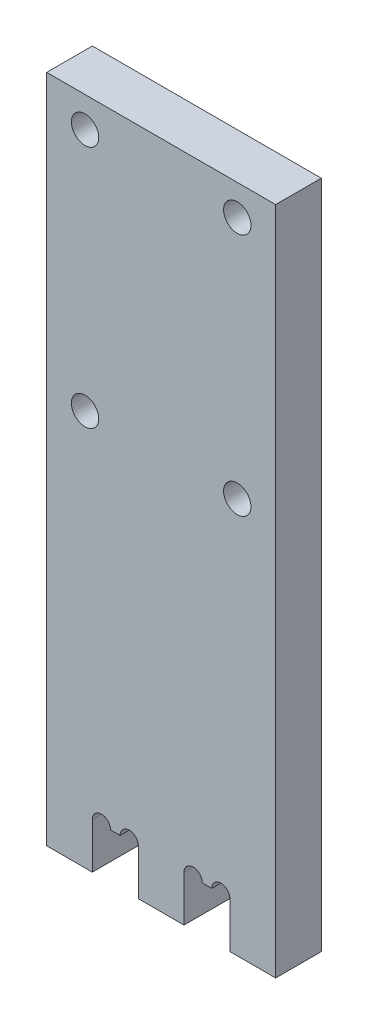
ISO-10303-21;
HEADER;
FILE_DESCRIPTION(('STEP AP214'),'2;1');
FILE_NAME('part.step','',(''),(''),'','','');
FILE_SCHEMA(('AUTOMOTIVE_DESIGN { 1 0 10303 214 1 1 1 1 }'));
ENDSEC;
DATA;
#1=APPLICATION_CONTEXT('core data for automotive mechanical design processes');
#2=APPLICATION_PROTOCOL_DEFINITION('international standard','automotive_design',2000,#1);
#3=PRODUCT_CONTEXT('',#1,'mechanical');
#4=PRODUCT('Part','Part','',(#3));
#5=PRODUCT_RELATED_PRODUCT_CATEGORY('part','',(#4));
#6=PRODUCT_DEFINITION_FORMATION('','',#4);
#7=PRODUCT_DEFINITION_CONTEXT('part definition',#1,'design');
#8=PRODUCT_DEFINITION('design','',#6,#7);
#9=PRODUCT_DEFINITION_SHAPE('','',#8);
#10=(LENGTH_UNIT() NAMED_UNIT(*) SI_UNIT(.MILLI.,.METRE.));
#11=(NAMED_UNIT(*) PLANE_ANGLE_UNIT() SI_UNIT($,.RADIAN.));
#12=(NAMED_UNIT(*) SI_UNIT($,.STERADIAN.) SOLID_ANGLE_UNIT());
#13=UNCERTAINTY_MEASURE_WITH_UNIT(LENGTH_MEASURE(1.E-05),#10,'distance_accuracy_value','');
#14=(GEOMETRIC_REPRESENTATION_CONTEXT(3) GLOBAL_UNCERTAINTY_ASSIGNED_CONTEXT((#13)) GLOBAL_UNIT_ASSIGNED_CONTEXT((#10,
#11,#12)) REPRESENTATION_CONTEXT('',''));
#15=CARTESIAN_POINT('',(0.,0.,0.));
#16=DIRECTION('',(0.,0.,1.));
#17=DIRECTION('',(1.,0.,0.));
#18=AXIS2_PLACEMENT_3D('',#15,#16,#17);
#19=CARTESIAN_POINT('',(18.,0.,15.));
#20=DIRECTION('',(0.,0.,-1.));
#21=DIRECTION('',(-1.,0.,0.));
#22=AXIS2_PLACEMENT_3D('',#19,#20,#21);
#23=PLANE('',#22);
#24=CARTESIAN_POINT('',(12.6,195.,15.));
#25=DIRECTION('',(0.,0.,1.));
#26=DIRECTION('',(1.,0.,0.));
#27=AXIS2_PLACEMENT_3D('',#24,#25,#26);
#28=CIRCLE('',#27,4.5);
#29=CARTESIAN_POINT('',(17.1,195.,15.));
#30=VERTEX_POINT('',#29);
#31=EDGE_CURVE('E520',#30,#30,#28,.T.);
#32=ORIENTED_EDGE('',*,*,#31,.F.);
#33=EDGE_LOOP('',(#32));
#34=FACE_BOUND('',#33,.T.);
#35=CARTESIAN_POINT('',(12.6,115.,15.));
#36=DIRECTION('',(0.,0.,1.));
#37=DIRECTION('',(1.,0.,0.));
#38=AXIS2_PLACEMENT_3D('',#35,#36,#37);
#39=CIRCLE('',#38,4.50000000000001);
#40=CARTESIAN_POINT('',(17.1,115.,15.));
#41=VERTEX_POINT('',#40);
#42=EDGE_CURVE('E180',#41,#41,#39,.T.);
#43=ORIENTED_EDGE('',*,*,#42,.F.);
#44=EDGE_LOOP('',(#43));
#45=FACE_BOUND('',#44,.T.);
#46=DIRECTION('',(0.,-1.,0.));
#47=VECTOR('',#46,1.);
#48=CARTESIAN_POINT('',(0.,205.,15.));
#49=LINE('',#48,#47);
#50=CARTESIAN_POINT('',(0.,205.,15.));
#51=VERTEX_POINT('',#50);
#52=CARTESIAN_POINT('',(0.,-15.,15.));
#53=VERTEX_POINT('',#52);
#54=EDGE_CURVE('E115',#51,#53,#49,.T.);
#55=ORIENTED_EDGE('',*,*,#54,.T.);
#56=DIRECTION('',(1.,0.,0.));
#57=VECTOR('',#56,1.);
#58=CARTESIAN_POINT('',(0.,-15.,15.));
#59=LINE('',#58,#57);
#60=CARTESIAN_POINT('',(15.,-15.,15.));
#61=VERTEX_POINT('',#60);
#62=EDGE_CURVE('E297',#53,#61,#59,.T.);
#63=ORIENTED_EDGE('',*,*,#62,.T.);
#64=DIRECTION('',(0.,1.,0.));
#65=VECTOR('',#64,1.);
#66=CARTESIAN_POINT('',(15.,-15.,15.));
#67=LINE('',#66,#65);
#68=CARTESIAN_POINT('',(15.,0.,15.));
#69=VERTEX_POINT('',#68);
#70=EDGE_CURVE('E248',#61,#69,#67,.T.);
#71=ORIENTED_EDGE('',*,*,#70,.T.);
#72=CARTESIAN_POINT('',(18.,0.,15.));
#73=DIRECTION('',(0.,0.,-1.));
#74=DIRECTION('',(-1.,0.,0.));
#75=AXIS2_PLACEMENT_3D('',#72,#73,#74);
#76=CIRCLE('',#75,3.);
#77=CARTESIAN_POINT('',(21.,0.,15.));
#78=VERTEX_POINT('',#77);
#79=EDGE_CURVE('E267',#69,#78,#76,.T.);
#80=ORIENTED_EDGE('',*,*,#79,.T.);
#81=DIRECTION('',(1.,0.,0.));
#82=VECTOR('',#81,1.);
#83=CARTESIAN_POINT('',(21.,0.,15.));
#84=LINE('',#83,#82);
#85=CARTESIAN_POINT('',(24.1,0.,15.));
#86=VERTEX_POINT('',#85);
#87=EDGE_CURVE('E264',#78,#86,#84,.T.);
#88=ORIENTED_EDGE('',*,*,#87,.T.);
#89=CARTESIAN_POINT('',(27.1,0.,15.));
#90=DIRECTION('',(0.,0.,-1.));
#91=DIRECTION('',(-1.,0.,0.));
#92=AXIS2_PLACEMENT_3D('',#89,#90,#91);
#93=CIRCLE('',#92,3.);
#94=CARTESIAN_POINT('',(30.1,0.,15.));
#95=VERTEX_POINT('',#94);
#96=EDGE_CURVE('E266',#86,#95,#93,.T.);
#97=ORIENTED_EDGE('',*,*,#96,.T.);
#98=DIRECTION('',(0.,-1.,0.));
#99=VECTOR('',#98,1.);
#100=CARTESIAN_POINT('',(30.1,0.,15.));
#101=LINE('',#100,#99);
#102=CARTESIAN_POINT('',(30.1,-15.,15.));
#103=VERTEX_POINT('',#102);
#104=EDGE_CURVE('E269',#95,#103,#101,.T.);
#105=ORIENTED_EDGE('',*,*,#104,.T.);
#106=DIRECTION('',(1.,0.,0.));
#107=VECTOR('',#106,1.);
#108=CARTESIAN_POINT('',(30.1,-15.,15.));
#109=LINE('',#108,#107);
#110=CARTESIAN_POINT('',(45.1,-15.,15.));
#111=VERTEX_POINT('',#110);
#112=EDGE_CURVE('E275',#103,#111,#109,.T.);
#113=ORIENTED_EDGE('',*,*,#112,.T.);
#114=DIRECTION('',(0.,1.,0.));
#115=VECTOR('',#114,1.);
#116=CARTESIAN_POINT('',(45.1,-15.,15.));
#117=LINE('',#116,#115);
#118=CARTESIAN_POINT('',(45.1,0.,15.));
#119=VERTEX_POINT('',#118);
#120=EDGE_CURVE('E277',#111,#119,#117,.T.);
#121=ORIENTED_EDGE('',*,*,#120,.T.);
#122=CARTESIAN_POINT('',(48.1,0.,15.));
#123=DIRECTION('',(0.,0.,-1.));
#124=DIRECTION('',(1.,0.,0.));
#125=AXIS2_PLACEMENT_3D('',#122,#123,#124);
#126=CIRCLE('',#125,3.);
#127=CARTESIAN_POINT('',(51.1,0.,15.));
#128=VERTEX_POINT('',#127);
#129=EDGE_CURVE('E279',#119,#128,#126,.T.);
#130=ORIENTED_EDGE('',*,*,#129,.T.);
#131=DIRECTION('',(1.,0.,0.));
#132=VECTOR('',#131,1.);
#133=CARTESIAN_POINT('',(51.1,0.,15.));
#134=LINE('',#133,#132);
#135=CARTESIAN_POINT('',(54.2,0.,15.));
#136=VERTEX_POINT('',#135);
#137=EDGE_CURVE('E281',#128,#136,#134,.T.);
#138=ORIENTED_EDGE('',*,*,#137,.T.);
#139=CARTESIAN_POINT('',(57.2,0.,15.));
#140=DIRECTION('',(0.,0.,-1.));
#141=DIRECTION('',(-1.,0.,0.));
#142=AXIS2_PLACEMENT_3D('',#139,#140,#141);
#143=CIRCLE('',#142,3.);
#144=CARTESIAN_POINT('',(60.2,0.,15.));
#145=VERTEX_POINT('',#144);
#146=EDGE_CURVE('E283',#136,#145,#143,.T.);
#147=ORIENTED_EDGE('',*,*,#146,.T.);
#148=DIRECTION('',(0.,-1.,0.));
#149=VECTOR('',#148,1.);
#150=CARTESIAN_POINT('',(60.2,0.,15.));
#151=LINE('',#150,#149);
#152=CARTESIAN_POINT('',(60.2,-15.,15.));
#153=VERTEX_POINT('',#152);
#154=EDGE_CURVE('E159',#145,#153,#151,.T.);
#155=ORIENTED_EDGE('',*,*,#154,.T.);
#156=DIRECTION('',(1.,0.,0.));
#157=VECTOR('',#156,1.);
#158=CARTESIAN_POINT('',(60.2,-15.,15.));
#159=LINE('',#158,#157);
#160=CARTESIAN_POINT('',(75.2,-15.,15.));
#161=VERTEX_POINT('',#160);
#162=EDGE_CURVE('E153',#153,#161,#159,.T.);
#163=ORIENTED_EDGE('',*,*,#162,.T.);
#164=DIRECTION('',(0.,1.,0.));
#165=VECTOR('',#164,1.);
#166=CARTESIAN_POINT('',(75.2,-15.,15.));
#167=LINE('',#166,#165);
#168=CARTESIAN_POINT('',(75.2,205.,15.));
#169=VERTEX_POINT('',#168);
#170=EDGE_CURVE('E157',#161,#169,#167,.T.);
#171=ORIENTED_EDGE('',*,*,#170,.T.);
#172=DIRECTION('',(-1.,0.,0.));
#173=VECTOR('',#172,1.);
#174=CARTESIAN_POINT('',(75.2,205.,15.));
#175=LINE('',#174,#173);
#176=EDGE_CURVE('E50',#169,#51,#175,.T.);
#177=ORIENTED_EDGE('',*,*,#176,.T.);
#178=EDGE_LOOP('',(#55,#63,#71,#80,#88,#97,#105,#113,#121,#130,#138,#147,#155,#163,#171,#177));
#179=FACE_BOUND('',#178,.T.);
#180=CARTESIAN_POINT('',(62.6,115.,15.));
#181=DIRECTION('',(0.,0.,1.));
#182=DIRECTION('',(1.,0.,0.));
#183=AXIS2_PLACEMENT_3D('',#180,#181,#182);
#184=CIRCLE('',#183,4.50000000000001);
#185=CARTESIAN_POINT('',(67.1,115.,15.));
#186=VERTEX_POINT('',#185);
#187=EDGE_CURVE('E526',#186,#186,#184,.T.);
#188=ORIENTED_EDGE('',*,*,#187,.F.);
#189=EDGE_LOOP('',(#188));
#190=FACE_BOUND('',#189,.T.);
#191=CARTESIAN_POINT('',(62.6,195.,15.));
#192=DIRECTION('',(0.,0.,1.));
#193=DIRECTION('',(1.,0.,0.));
#194=AXIS2_PLACEMENT_3D('',#191,#192,#193);
#195=CIRCLE('',#194,4.50000000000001);
#196=CARTESIAN_POINT('',(67.1,195.,15.));
#197=VERTEX_POINT('',#196);
#198=EDGE_CURVE('E511',#197,#197,#195,.T.);
#199=ORIENTED_EDGE('',*,*,#198,.F.);
#200=EDGE_LOOP('',(#199));
#201=FACE_BOUND('',#200,.T.);
#202=ADVANCED_FACE('F33',(#34,#45,#179,#190,#201),#23,.F.);
#203=CARTESIAN_POINT('',(18.,0.,0.));
#204=DIRECTION('',(0.,0.,-1.));
#205=DIRECTION('',(-1.,0.,0.));
#206=AXIS2_PLACEMENT_3D('',#203,#204,#205);
#207=PLANE('',#206);
#208=CARTESIAN_POINT('',(12.6,195.,0.));
#209=DIRECTION('',(0.,0.,1.));
#210=DIRECTION('',(1.,0.,0.));
#211=AXIS2_PLACEMENT_3D('',#208,#209,#210);
#212=CIRCLE('',#211,4.5);
#213=CARTESIAN_POINT('',(17.1,195.,0.));
#214=VERTEX_POINT('',#213);
#215=EDGE_CURVE('E517',#214,#214,#212,.T.);
#216=ORIENTED_EDGE('',*,*,#215,.T.);
#217=EDGE_LOOP('',(#216));
#218=FACE_BOUND('',#217,.T.);
#219=CARTESIAN_POINT('',(12.6,115.,0.));
#220=DIRECTION('',(0.,0.,1.));
#221=DIRECTION('',(1.,0.,0.));
#222=AXIS2_PLACEMENT_3D('',#219,#220,#221);
#223=CIRCLE('',#222,4.50000000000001);
#224=CARTESIAN_POINT('',(17.1,115.,0.));
#225=VERTEX_POINT('',#224);
#226=EDGE_CURVE('E301',#225,#225,#223,.T.);
#227=ORIENTED_EDGE('',*,*,#226,.T.);
#228=EDGE_LOOP('',(#227));
#229=FACE_BOUND('',#228,.T.);
#230=DIRECTION('',(0.,-1.,0.));
#231=VECTOR('',#230,1.);
#232=CARTESIAN_POINT('',(0.,0.,0.));
#233=LINE('',#232,#231);
#234=CARTESIAN_POINT('',(0.,205.,0.));
#235=VERTEX_POINT('',#234);
#236=CARTESIAN_POINT('',(0.,-15.,0.));
#237=VERTEX_POINT('',#236);
#238=EDGE_CURVE('E109',#235,#237,#233,.T.);
#239=ORIENTED_EDGE('',*,*,#238,.F.);
#240=DIRECTION('',(-1.,0.,0.));
#241=VECTOR('',#240,1.);
#242=CARTESIAN_POINT('',(75.2,205.,0.));
#243=LINE('',#242,#241);
#244=CARTESIAN_POINT('',(75.2,205.,0.));
#245=VERTEX_POINT('',#244);
#246=EDGE_CURVE('E206',#245,#235,#243,.T.);
#247=ORIENTED_EDGE('',*,*,#246,.F.);
#248=DIRECTION('',(0.,1.,0.));
#249=VECTOR('',#248,1.);
#250=CARTESIAN_POINT('',(75.2,-8.23033587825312,0.));
#251=LINE('',#250,#249);
#252=CARTESIAN_POINT('',(75.2,-15.,0.));
#253=VERTEX_POINT('',#252);
#254=EDGE_CURVE('E102',#253,#245,#251,.T.);
#255=ORIENTED_EDGE('',*,*,#254,.F.);
#256=DIRECTION('',(1.,0.,0.));
#257=VECTOR('',#256,1.);
#258=CARTESIAN_POINT('',(60.2,-15.,0.));
#259=LINE('',#258,#257);
#260=CARTESIAN_POINT('',(60.2,-15.,0.));
#261=VERTEX_POINT('',#260);
#262=EDGE_CURVE('E168',#261,#253,#259,.T.);
#263=ORIENTED_EDGE('',*,*,#262,.F.);
#264=DIRECTION('',(0.,-1.,0.));
#265=VECTOR('',#264,1.);
#266=CARTESIAN_POINT('',(60.2,0.,0.));
#267=LINE('',#266,#265);
#268=CARTESIAN_POINT('',(60.2,0.,0.));
#269=VERTEX_POINT('',#268);
#270=EDGE_CURVE('E202',#269,#261,#267,.T.);
#271=ORIENTED_EDGE('',*,*,#270,.F.);
#272=CARTESIAN_POINT('',(57.2,0.,0.));
#273=DIRECTION('',(0.,0.,-1.));
#274=DIRECTION('',(-1.,0.,0.));
#275=AXIS2_PLACEMENT_3D('',#272,#273,#274);
#276=CIRCLE('',#275,3.);
#277=CARTESIAN_POINT('',(54.2,0.,0.));
#278=VERTEX_POINT('',#277);
#279=EDGE_CURVE('E200',#278,#269,#276,.T.);
#280=ORIENTED_EDGE('',*,*,#279,.F.);
#281=DIRECTION('',(1.,0.,0.));
#282=VECTOR('',#281,1.);
#283=CARTESIAN_POINT('',(51.1,0.,0.));
#284=LINE('',#283,#282);
#285=CARTESIAN_POINT('',(51.1,0.,0.));
#286=VERTEX_POINT('',#285);
#287=EDGE_CURVE('E198',#286,#278,#284,.T.);
#288=ORIENTED_EDGE('',*,*,#287,.F.);
#289=CARTESIAN_POINT('',(48.1,0.,0.));
#290=DIRECTION('',(0.,0.,-1.));
#291=DIRECTION('',(1.,0.,0.));
#292=AXIS2_PLACEMENT_3D('',#289,#290,#291);
#293=CIRCLE('',#292,3.);
#294=CARTESIAN_POINT('',(45.1,0.,0.));
#295=VERTEX_POINT('',#294);
#296=EDGE_CURVE('E196',#295,#286,#293,.T.);
#297=ORIENTED_EDGE('',*,*,#296,.F.);
#298=DIRECTION('',(0.,1.,0.));
#299=VECTOR('',#298,1.);
#300=CARTESIAN_POINT('',(45.1,-15.,0.));
#301=LINE('',#300,#299);
#302=CARTESIAN_POINT('',(45.1,-15.,0.));
#303=VERTEX_POINT('',#302);
#304=EDGE_CURVE('E194',#303,#295,#301,.T.);
#305=ORIENTED_EDGE('',*,*,#304,.F.);
#306=DIRECTION('',(1.,0.,0.));
#307=VECTOR('',#306,1.);
#308=CARTESIAN_POINT('',(30.1,-15.,0.));
#309=LINE('',#308,#307);
#310=CARTESIAN_POINT('',(30.1,-15.,0.));
#311=VERTEX_POINT('',#310);
#312=EDGE_CURVE('E192',#311,#303,#309,.T.);
#313=ORIENTED_EDGE('',*,*,#312,.F.);
#314=DIRECTION('',(0.,-1.,0.));
#315=VECTOR('',#314,1.);
#316=CARTESIAN_POINT('',(30.1,0.,0.));
#317=LINE('',#316,#315);
#318=CARTESIAN_POINT('',(30.1,0.,0.));
#319=VERTEX_POINT('',#318);
#320=EDGE_CURVE('E190',#319,#311,#317,.T.);
#321=ORIENTED_EDGE('',*,*,#320,.F.);
#322=CARTESIAN_POINT('',(27.1,0.,0.));
#323=DIRECTION('',(0.,0.,-1.));
#324=DIRECTION('',(-1.,0.,0.));
#325=AXIS2_PLACEMENT_3D('',#322,#323,#324);
#326=CIRCLE('',#325,3.);
#327=CARTESIAN_POINT('',(24.1,0.,0.));
#328=VERTEX_POINT('',#327);
#329=EDGE_CURVE('E188',#328,#319,#326,.T.);
#330=ORIENTED_EDGE('',*,*,#329,.F.);
#331=DIRECTION('',(1.,0.,0.));
#332=VECTOR('',#331,1.);
#333=CARTESIAN_POINT('',(21.,0.,0.));
#334=LINE('',#333,#332);
#335=CARTESIAN_POINT('',(21.,0.,0.));
#336=VERTEX_POINT('',#335);
#337=EDGE_CURVE('E186',#336,#328,#334,.T.);
#338=ORIENTED_EDGE('',*,*,#337,.F.);
#339=CARTESIAN_POINT('',(18.,0.,0.));
#340=DIRECTION('',(0.,0.,-1.));
#341=DIRECTION('',(-1.,0.,0.));
#342=AXIS2_PLACEMENT_3D('',#339,#340,#341);
#343=CIRCLE('',#342,3.);
#344=CARTESIAN_POINT('',(15.,0.,0.));
#345=VERTEX_POINT('',#344);
#346=EDGE_CURVE('E184',#345,#336,#343,.T.);
#347=ORIENTED_EDGE('',*,*,#346,.F.);
#348=DIRECTION('',(0.,1.,0.));
#349=VECTOR('',#348,1.);
#350=CARTESIAN_POINT('',(15.,-15.,0.));
#351=LINE('',#350,#349);
#352=CARTESIAN_POINT('',(15.,-15.,0.));
#353=VERTEX_POINT('',#352);
#354=EDGE_CURVE('E182',#353,#345,#351,.T.);
#355=ORIENTED_EDGE('',*,*,#354,.F.);
#356=DIRECTION('',(1.,0.,0.));
#357=VECTOR('',#356,1.);
#358=CARTESIAN_POINT('',(0.,-15.,0.));
#359=LINE('',#358,#357);
#360=EDGE_CURVE('E179',#237,#353,#359,.T.);
#361=ORIENTED_EDGE('',*,*,#360,.F.);
#362=EDGE_LOOP('',(#239,#247,#255,#263,#271,#280,#288,#297,#305,#313,#321,#330,#338,#347,#355,#361));
#363=FACE_BOUND('',#362,.T.);
#364=CARTESIAN_POINT('',(62.6,115.,0.));
#365=DIRECTION('',(0.,0.,1.));
#366=DIRECTION('',(1.,0.,0.));
#367=AXIS2_PLACEMENT_3D('',#364,#365,#366);
#368=CIRCLE('',#367,4.50000000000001);
#369=CARTESIAN_POINT('',(67.1,115.,0.));
#370=VERTEX_POINT('',#369);
#371=EDGE_CURVE('E523',#370,#370,#368,.T.);
#372=ORIENTED_EDGE('',*,*,#371,.T.);
#373=EDGE_LOOP('',(#372));
#374=FACE_BOUND('',#373,.T.);
#375=CARTESIAN_POINT('',(62.6,195.,0.));
#376=DIRECTION('',(0.,0.,1.));
#377=DIRECTION('',(1.,0.,0.));
#378=AXIS2_PLACEMENT_3D('',#375,#376,#377);
#379=CIRCLE('',#378,4.50000000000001);
#380=CARTESIAN_POINT('',(67.1,195.,0.));
#381=VERTEX_POINT('',#380);
#382=EDGE_CURVE('E514',#381,#381,#379,.T.);
#383=ORIENTED_EDGE('',*,*,#382,.T.);
#384=EDGE_LOOP('',(#383));
#385=FACE_BOUND('',#384,.T.);
#386=ADVANCED_FACE('F252',(#218,#229,#363,#374,#385),#207,.T.);
#387=CARTESIAN_POINT('',(0.,0.,15.));
#388=DIRECTION('',(1.,0.,0.));
#389=DIRECTION('',(0.,1.,0.));
#390=AXIS2_PLACEMENT_3D('',#387,#388,#389);
#391=PLANE('',#390);
#392=ORIENTED_EDGE('',*,*,#238,.T.);
#393=DIRECTION('',(0.,0.,-1.));
#394=VECTOR('',#393,1.);
#395=CARTESIAN_POINT('',(0.,-15.,15.));
#396=LINE('',#395,#394);
#397=EDGE_CURVE('E11',#53,#237,#396,.T.);
#398=ORIENTED_EDGE('',*,*,#397,.F.);
#399=ORIENTED_EDGE('',*,*,#54,.F.);
#400=DIRECTION('',(0.,0.,-1.));
#401=VECTOR('',#400,1.);
#402=CARTESIAN_POINT('',(0.,205.,15.));
#403=LINE('',#402,#401);
#404=EDGE_CURVE('E174',#51,#235,#403,.T.);
#405=ORIENTED_EDGE('',*,*,#404,.T.);
#406=EDGE_LOOP('',(#392,#398,#399,#405));
#407=FACE_BOUND('',#406,.T.);
#408=ADVANCED_FACE('F35',(#407),#391,.F.);
#409=CARTESIAN_POINT('',(0.,-15.,15.));
#410=DIRECTION('',(0.,1.,0.));
#411=DIRECTION('',(0.,0.,1.));
#412=AXIS2_PLACEMENT_3D('',#409,#410,#411);
#413=PLANE('',#412);
#414=ORIENTED_EDGE('',*,*,#360,.T.);
#415=DIRECTION('',(0.,0.,-1.));
#416=VECTOR('',#415,1.);
#417=CARTESIAN_POINT('',(15.,-15.,15.));
#418=LINE('',#417,#416);
#419=EDGE_CURVE('E42',#61,#353,#418,.T.);
#420=ORIENTED_EDGE('',*,*,#419,.F.);
#421=ORIENTED_EDGE('',*,*,#62,.F.);
#422=ORIENTED_EDGE('',*,*,#397,.T.);
#423=EDGE_LOOP('',(#414,#420,#421,#422));
#424=FACE_BOUND('',#423,.T.);
#425=ADVANCED_FACE('F303',(#424),#413,.F.);
#426=CARTESIAN_POINT('',(15.,-15.,15.));
#427=DIRECTION('',(-1.,0.,0.));
#428=DIRECTION('',(0.,0.,1.));
#429=AXIS2_PLACEMENT_3D('',#426,#427,#428);
#430=PLANE('',#429);
#431=ORIENTED_EDGE('',*,*,#354,.T.);
#432=DIRECTION('',(0.,0.,-1.));
#433=VECTOR('',#432,1.);
#434=CARTESIAN_POINT('',(15.,0.,15.));
#435=LINE('',#434,#433);
#436=EDGE_CURVE('E239',#69,#345,#435,.T.);
#437=ORIENTED_EDGE('',*,*,#436,.F.);
#438=ORIENTED_EDGE('',*,*,#70,.F.);
#439=ORIENTED_EDGE('',*,*,#419,.T.);
#440=EDGE_LOOP('',(#431,#437,#438,#439));
#441=FACE_BOUND('',#440,.T.);
#442=ADVANCED_FACE('F246',(#441),#430,.F.);
#443=CARTESIAN_POINT('',(18.,0.,15.));
#444=DIRECTION('',(0.,0.,-1.));
#445=DIRECTION('',(-1.,0.,0.));
#446=AXIS2_PLACEMENT_3D('',#443,#444,#445);
#447=CYLINDRICAL_SURFACE('',#446,3.);
#448=ORIENTED_EDGE('',*,*,#346,.T.);
#449=DIRECTION('',(0.,0.,-1.));
#450=VECTOR('',#449,1.);
#451=CARTESIAN_POINT('',(21.,0.,15.));
#452=LINE('',#451,#450);
#453=EDGE_CURVE('E236',#78,#336,#452,.T.);
#454=ORIENTED_EDGE('',*,*,#453,.F.);
#455=ORIENTED_EDGE('',*,*,#79,.F.);
#456=ORIENTED_EDGE('',*,*,#436,.T.);
#457=EDGE_LOOP('',(#448,#454,#455,#456));
#458=FACE_BOUND('',#457,.T.);
#459=ADVANCED_FACE('F258',(#458),#447,.F.);
#460=CARTESIAN_POINT('',(21.,0.,15.));
#461=DIRECTION('',(0.,1.,0.));
#462=DIRECTION('',(0.,0.,1.));
#463=AXIS2_PLACEMENT_3D('',#460,#461,#462);
#464=PLANE('',#463);
#465=ORIENTED_EDGE('',*,*,#337,.T.);
#466=DIRECTION('',(0.,0.,-1.));
#467=VECTOR('',#466,1.);
#468=CARTESIAN_POINT('',(24.1,0.,15.));
#469=LINE('',#468,#467);
#470=EDGE_CURVE('E233',#86,#328,#469,.T.);
#471=ORIENTED_EDGE('',*,*,#470,.F.);
#472=ORIENTED_EDGE('',*,*,#87,.F.);
#473=ORIENTED_EDGE('',*,*,#453,.T.);
#474=EDGE_LOOP('',(#465,#471,#472,#473));
#475=FACE_BOUND('',#474,.T.);
#476=ADVANCED_FACE('F262',(#475),#464,.F.);
#477=CARTESIAN_POINT('',(27.1,0.,15.));
#478=DIRECTION('',(0.,0.,-1.));
#479=DIRECTION('',(-1.,0.,0.));
#480=AXIS2_PLACEMENT_3D('',#477,#478,#479);
#481=CYLINDRICAL_SURFACE('',#480,3.);
#482=ORIENTED_EDGE('',*,*,#329,.T.);
#483=DIRECTION('',(0.,0.,-1.));
#484=VECTOR('',#483,1.);
#485=CARTESIAN_POINT('',(30.1,0.,15.));
#486=LINE('',#485,#484);
#487=EDGE_CURVE('E230',#95,#319,#486,.T.);
#488=ORIENTED_EDGE('',*,*,#487,.F.);
#489=ORIENTED_EDGE('',*,*,#96,.F.);
#490=ORIENTED_EDGE('',*,*,#470,.T.);
#491=EDGE_LOOP('',(#482,#488,#489,#490));
#492=FACE_BOUND('',#491,.T.);
#493=ADVANCED_FACE('F353',(#492),#481,.F.);
#494=CARTESIAN_POINT('',(30.1,0.,15.));
#495=DIRECTION('',(1.,0.,0.));
#496=DIRECTION('',(0.,0.,-1.));
#497=AXIS2_PLACEMENT_3D('',#494,#495,#496);
#498=PLANE('',#497);
#499=ORIENTED_EDGE('',*,*,#320,.T.);
#500=DIRECTION('',(0.,0.,-1.));
#501=VECTOR('',#500,1.);
#502=CARTESIAN_POINT('',(30.1,-15.,15.));
#503=LINE('',#502,#501);
#504=EDGE_CURVE('E227',#103,#311,#503,.T.);
#505=ORIENTED_EDGE('',*,*,#504,.F.);
#506=ORIENTED_EDGE('',*,*,#104,.F.);
#507=ORIENTED_EDGE('',*,*,#487,.T.);
#508=EDGE_LOOP('',(#499,#505,#506,#507));
#509=FACE_BOUND('',#508,.T.);
#510=ADVANCED_FACE('F349',(#509),#498,.F.);
#511=CARTESIAN_POINT('',(30.1,-15.,15.));
#512=DIRECTION('',(0.,1.,0.));
#513=DIRECTION('',(0.,0.,1.));
#514=AXIS2_PLACEMENT_3D('',#511,#512,#513);
#515=PLANE('',#514);
#516=ORIENTED_EDGE('',*,*,#312,.T.);
#517=DIRECTION('',(0.,0.,-1.));
#518=VECTOR('',#517,1.);
#519=CARTESIAN_POINT('',(45.1,-15.,15.));
#520=LINE('',#519,#518);
#521=EDGE_CURVE('E224',#111,#303,#520,.T.);
#522=ORIENTED_EDGE('',*,*,#521,.F.);
#523=ORIENTED_EDGE('',*,*,#112,.F.);
#524=ORIENTED_EDGE('',*,*,#504,.T.);
#525=EDGE_LOOP('',(#516,#522,#523,#524));
#526=FACE_BOUND('',#525,.T.);
#527=ADVANCED_FACE('F345',(#526),#515,.F.);
#528=CARTESIAN_POINT('',(45.1,-15.,15.));
#529=DIRECTION('',(-1.,0.,0.));
#530=DIRECTION('',(0.,0.,1.));
#531=AXIS2_PLACEMENT_3D('',#528,#529,#530);
#532=PLANE('',#531);
#533=ORIENTED_EDGE('',*,*,#304,.T.);
#534=DIRECTION('',(0.,0.,-1.));
#535=VECTOR('',#534,1.);
#536=CARTESIAN_POINT('',(45.1,0.,15.));
#537=LINE('',#536,#535);
#538=EDGE_CURVE('E221',#119,#295,#537,.T.);
#539=ORIENTED_EDGE('',*,*,#538,.F.);
#540=ORIENTED_EDGE('',*,*,#120,.F.);
#541=ORIENTED_EDGE('',*,*,#521,.T.);
#542=EDGE_LOOP('',(#533,#539,#540,#541));
#543=FACE_BOUND('',#542,.T.);
#544=ADVANCED_FACE('F341',(#543),#532,.F.);
#545=CARTESIAN_POINT('',(48.1,0.,15.));
#546=DIRECTION('',(0.,0.,-1.));
#547=DIRECTION('',(-1.,0.,0.));
#548=AXIS2_PLACEMENT_3D('',#545,#546,#547);
#549=CYLINDRICAL_SURFACE('',#548,3.);
#550=ORIENTED_EDGE('',*,*,#296,.T.);
#551=DIRECTION('',(0.,0.,-1.));
#552=VECTOR('',#551,1.);
#553=CARTESIAN_POINT('',(51.1,0.,15.));
#554=LINE('',#553,#552);
#555=EDGE_CURVE('E218',#128,#286,#554,.T.);
#556=ORIENTED_EDGE('',*,*,#555,.F.);
#557=ORIENTED_EDGE('',*,*,#129,.F.);
#558=ORIENTED_EDGE('',*,*,#538,.T.);
#559=EDGE_LOOP('',(#550,#556,#557,#558));
#560=FACE_BOUND('',#559,.T.);
#561=ADVANCED_FACE('F337',(#560),#549,.F.);
#562=CARTESIAN_POINT('',(51.1,0.,15.));
#563=DIRECTION('',(0.,1.,0.));
#564=DIRECTION('',(0.,0.,1.));
#565=AXIS2_PLACEMENT_3D('',#562,#563,#564);
#566=PLANE('',#565);
#567=ORIENTED_EDGE('',*,*,#287,.T.);
#568=DIRECTION('',(0.,0.,-1.));
#569=VECTOR('',#568,1.);
#570=CARTESIAN_POINT('',(54.2,0.,15.));
#571=LINE('',#570,#569);
#572=EDGE_CURVE('E215',#136,#278,#571,.T.);
#573=ORIENTED_EDGE('',*,*,#572,.F.);
#574=ORIENTED_EDGE('',*,*,#137,.F.);
#575=ORIENTED_EDGE('',*,*,#555,.T.);
#576=EDGE_LOOP('',(#567,#573,#574,#575));
#577=FACE_BOUND('',#576,.T.);
#578=ADVANCED_FACE('F334',(#577),#566,.F.);
#579=CARTESIAN_POINT('',(57.2,0.,15.));
#580=DIRECTION('',(0.,0.,-1.));
#581=DIRECTION('',(-1.,0.,0.));
#582=AXIS2_PLACEMENT_3D('',#579,#580,#581);
#583=CYLINDRICAL_SURFACE('',#582,3.);
#584=ORIENTED_EDGE('',*,*,#279,.T.);
#585=DIRECTION('',(0.,0.,-1.));
#586=VECTOR('',#585,1.);
#587=CARTESIAN_POINT('',(60.2,0.,15.));
#588=LINE('',#587,#586);
#589=EDGE_CURVE('E212',#145,#269,#588,.T.);
#590=ORIENTED_EDGE('',*,*,#589,.F.);
#591=ORIENTED_EDGE('',*,*,#146,.F.);
#592=ORIENTED_EDGE('',*,*,#572,.T.);
#593=EDGE_LOOP('',(#584,#590,#591,#592));
#594=FACE_BOUND('',#593,.T.);
#595=ADVANCED_FACE('F289',(#594),#583,.F.);
#596=CARTESIAN_POINT('',(60.2,0.,15.));
#597=DIRECTION('',(1.,0.,0.));
#598=DIRECTION('',(0.,0.,-1.));
#599=AXIS2_PLACEMENT_3D('',#596,#597,#598);
#600=PLANE('',#599);
#601=ORIENTED_EDGE('',*,*,#270,.T.);
#602=DIRECTION('',(0.,0.,-1.));
#603=VECTOR('',#602,1.);
#604=CARTESIAN_POINT('',(60.2,-15.,15.));
#605=LINE('',#604,#603);
#606=EDGE_CURVE('E169',#153,#261,#605,.T.);
#607=ORIENTED_EDGE('',*,*,#606,.F.);
#608=ORIENTED_EDGE('',*,*,#154,.F.);
#609=ORIENTED_EDGE('',*,*,#589,.T.);
#610=EDGE_LOOP('',(#601,#607,#608,#609));
#611=FACE_BOUND('',#610,.T.);
#612=ADVANCED_FACE('F293',(#611),#600,.F.);
#613=CARTESIAN_POINT('',(60.2,-15.,15.));
#614=DIRECTION('',(0.,1.,0.));
#615=DIRECTION('',(0.,0.,1.));
#616=AXIS2_PLACEMENT_3D('',#613,#614,#615);
#617=PLANE('',#616);
#618=ORIENTED_EDGE('',*,*,#262,.T.);
#619=DIRECTION('',(0.,0.,-1.));
#620=VECTOR('',#619,1.);
#621=CARTESIAN_POINT('',(75.2,-15.,15.));
#622=LINE('',#621,#620);
#623=EDGE_CURVE('E165',#161,#253,#622,.T.);
#624=ORIENTED_EDGE('',*,*,#623,.F.);
#625=ORIENTED_EDGE('',*,*,#162,.F.);
#626=ORIENTED_EDGE('',*,*,#606,.T.);
#627=EDGE_LOOP('',(#618,#624,#625,#626));
#628=FACE_BOUND('',#627,.T.);
#629=ADVANCED_FACE('F166',(#628),#617,.F.);
#630=CARTESIAN_POINT('',(75.2,-8.23033587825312,15.));
#631=DIRECTION('',(-1.,0.,0.));
#632=DIRECTION('',(0.,0.,1.));
#633=AXIS2_PLACEMENT_3D('',#630,#631,#632);
#634=PLANE('',#633);
#635=ORIENTED_EDGE('',*,*,#254,.T.);
#636=DIRECTION('',(0.,0.,-1.));
#637=VECTOR('',#636,1.);
#638=CARTESIAN_POINT('',(75.2,205.,15.));
#639=LINE('',#638,#637);
#640=EDGE_CURVE('E170',#169,#245,#639,.T.);
#641=ORIENTED_EDGE('',*,*,#640,.F.);
#642=ORIENTED_EDGE('',*,*,#170,.F.);
#643=ORIENTED_EDGE('',*,*,#623,.T.);
#644=EDGE_LOOP('',(#635,#641,#642,#643));
#645=FACE_BOUND('',#644,.T.);
#646=ADVANCED_FACE('F172',(#645),#634,.F.);
#647=CARTESIAN_POINT('',(75.2,205.,15.));
#648=DIRECTION('',(0.,-1.,0.));
#649=DIRECTION('',(0.,0.,-1.));
#650=AXIS2_PLACEMENT_3D('',#647,#648,#649);
#651=PLANE('',#650);
#652=ORIENTED_EDGE('',*,*,#246,.T.);
#653=ORIENTED_EDGE('',*,*,#404,.F.);
#654=ORIENTED_EDGE('',*,*,#176,.F.);
#655=ORIENTED_EDGE('',*,*,#640,.T.);
#656=EDGE_LOOP('',(#652,#653,#654,#655));
#657=FACE_BOUND('',#656,.T.);
#658=ADVANCED_FACE('F295',(#657),#651,.F.);
#659=CARTESIAN_POINT('',(12.6,115.,15.));
#660=DIRECTION('',(0.,0.,-1.));
#661=DIRECTION('',(-1.,0.,0.));
#662=AXIS2_PLACEMENT_3D('',#659,#660,#661);
#663=CYLINDRICAL_SURFACE('',#662,4.50000000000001);
#664=ORIENTED_EDGE('',*,*,#42,.T.);
#665=EDGE_LOOP('',(#664));
#666=FACE_BOUND('',#665,.T.);
#667=ORIENTED_EDGE('',*,*,#226,.F.);
#668=EDGE_LOOP('',(#667));
#669=FACE_BOUND('',#668,.T.);
#670=ADVANCED_FACE('F321',(#666,#669),#663,.F.);
#671=CARTESIAN_POINT('',(62.6,115.,15.));
#672=DIRECTION('',(0.,0.,-1.));
#673=DIRECTION('',(-1.,0.,0.));
#674=AXIS2_PLACEMENT_3D('',#671,#672,#673);
#675=CYLINDRICAL_SURFACE('',#674,4.50000000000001);
#676=ORIENTED_EDGE('',*,*,#187,.T.);
#677=EDGE_LOOP('',(#676));
#678=FACE_BOUND('',#677,.T.);
#679=ORIENTED_EDGE('',*,*,#371,.F.);
#680=EDGE_LOOP('',(#679));
#681=FACE_BOUND('',#680,.T.);
#682=ADVANCED_FACE('F419',(#678,#681),#675,.F.);
#683=CARTESIAN_POINT('',(12.6,195.,15.));
#684=DIRECTION('',(0.,0.,-1.));
#685=DIRECTION('',(-1.,0.,0.));
#686=AXIS2_PLACEMENT_3D('',#683,#684,#685);
#687=CYLINDRICAL_SURFACE('',#686,4.5);
#688=ORIENTED_EDGE('',*,*,#31,.T.);
#689=EDGE_LOOP('',(#688));
#690=FACE_BOUND('',#689,.T.);
#691=ORIENTED_EDGE('',*,*,#215,.F.);
#692=EDGE_LOOP('',(#691));
#693=FACE_BOUND('',#692,.T.);
#694=ADVANCED_FACE('F426',(#690,#693),#687,.F.);
#695=CARTESIAN_POINT('',(62.6,195.,15.));
#696=DIRECTION('',(0.,0.,-1.));
#697=DIRECTION('',(-1.,0.,0.));
#698=AXIS2_PLACEMENT_3D('',#695,#696,#697);
#699=CYLINDRICAL_SURFACE('',#698,4.50000000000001);
#700=ORIENTED_EDGE('',*,*,#198,.T.);
#701=EDGE_LOOP('',(#700));
#702=FACE_BOUND('',#701,.T.);
#703=ORIENTED_EDGE('',*,*,#382,.F.);
#704=EDGE_LOOP('',(#703));
#705=FACE_BOUND('',#704,.T.);
#706=ADVANCED_FACE('F433',(#702,#705),#699,.F.);
#707=CLOSED_SHELL('',(#202,#386,#408,#425,#442,#459,#476,#493,#510,#527,#544,#561,#578,#595,
#612,#629,#646,#658,#670,#682,#694,#706));
#708=MANIFOLD_SOLID_BREP('B2',#707);
#709=ADVANCED_BREP_SHAPE_REPRESENTATION('',(#18,#708),#14);
#710=SHAPE_DEFINITION_REPRESENTATION(#9,#709);
ENDSEC;
END-ISO-10303-21;
